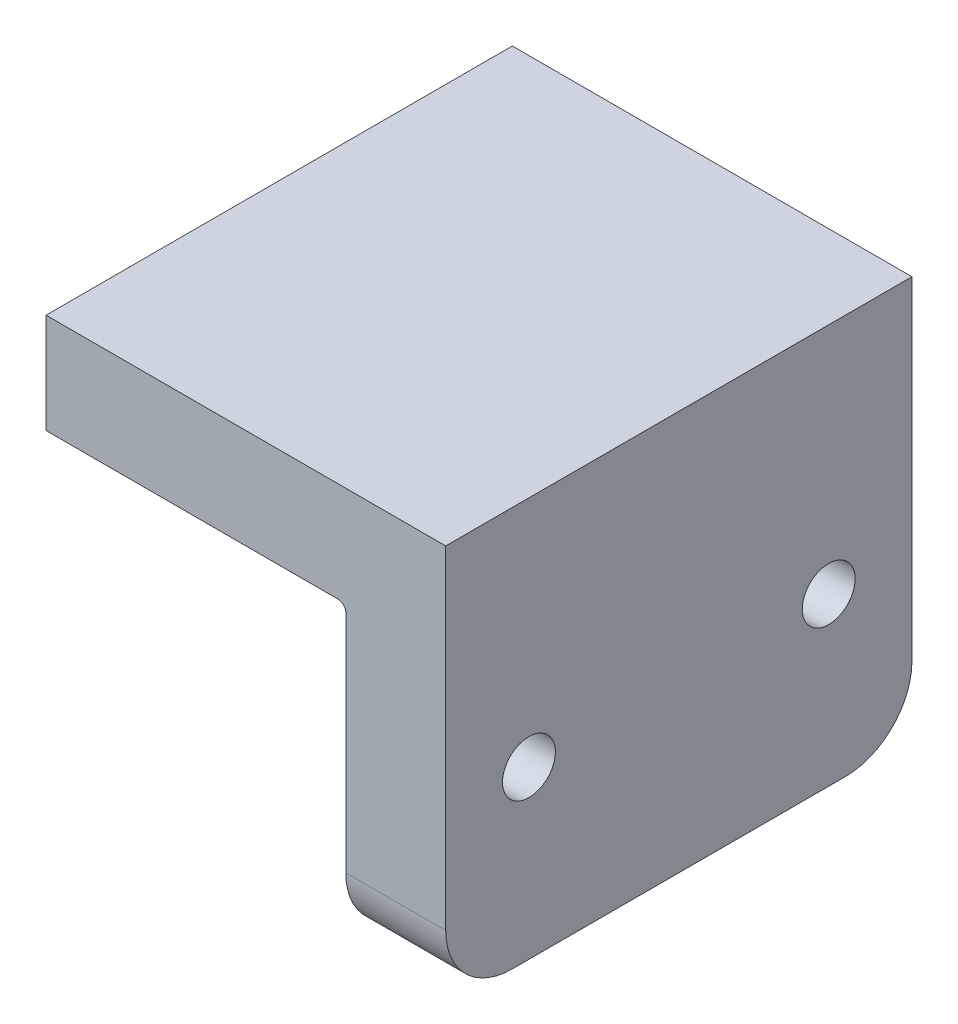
ISO-10303-21;
HEADER;
FILE_DESCRIPTION(('STEP AP214'),'2;1');
FILE_NAME('part.step','',(''),(''),'','','');
FILE_SCHEMA(('AUTOMOTIVE_DESIGN { 1 0 10303 214 1 1 1 1 }'));
ENDSEC;
DATA;
#1=APPLICATION_CONTEXT('core data for automotive mechanical design processes');
#2=APPLICATION_PROTOCOL_DEFINITION('international standard','automotive_design',2000,#1);
#3=PRODUCT_CONTEXT('',#1,'mechanical');
#4=PRODUCT('Part','Part','',(#3));
#5=PRODUCT_RELATED_PRODUCT_CATEGORY('part','',(#4));
#6=PRODUCT_DEFINITION_FORMATION('','',#4);
#7=PRODUCT_DEFINITION_CONTEXT('part definition',#1,'design');
#8=PRODUCT_DEFINITION('design','',#6,#7);
#9=PRODUCT_DEFINITION_SHAPE('','',#8);
#10=(LENGTH_UNIT() NAMED_UNIT(*) SI_UNIT(.MILLI.,.METRE.));
#11=(NAMED_UNIT(*) PLANE_ANGLE_UNIT() SI_UNIT($,.RADIAN.));
#12=(NAMED_UNIT(*) SI_UNIT($,.STERADIAN.) SOLID_ANGLE_UNIT());
#13=UNCERTAINTY_MEASURE_WITH_UNIT(LENGTH_MEASURE(1.E-05),#10,'distance_accuracy_value','');
#14=(GEOMETRIC_REPRESENTATION_CONTEXT(3) GLOBAL_UNCERTAINTY_ASSIGNED_CONTEXT((#13)) GLOBAL_UNIT_ASSIGNED_CONTEXT((#10,
#11,#12)) REPRESENTATION_CONTEXT('',''));
#15=CARTESIAN_POINT('',(0.,0.,0.));
#16=DIRECTION('',(0.,0.,1.));
#17=DIRECTION('',(1.,0.,0.));
#18=AXIS2_PLACEMENT_3D('',#15,#16,#17);
#19=CARTESIAN_POINT('',(0.,0.,44.45));
#20=DIRECTION('',(0.,-1.,0.));
#21=DIRECTION('',(1.,0.,0.));
#22=AXIS2_PLACEMENT_3D('',#19,#20,#21);
#23=PLANE('',#22);
#24=DIRECTION('',(-1.,0.,0.));
#25=VECTOR('',#24,1.);
#26=CARTESIAN_POINT('',(0.,0.,-44.45));
#27=LINE('',#26,#25);
#28=CARTESIAN_POINT('',(0.,0.,-44.45));
#29=VERTEX_POINT('',#28);
#30=CARTESIAN_POINT('',(-76.2,0.,-44.45));
#31=VERTEX_POINT('',#30);
#32=EDGE_CURVE('E135',#29,#31,#27,.T.);
#33=ORIENTED_EDGE('',*,*,#32,.T.);
#34=DIRECTION('',(0.,0.,-1.));
#35=VECTOR('',#34,1.);
#36=CARTESIAN_POINT('',(-76.2,0.,44.45));
#37=LINE('',#36,#35);
#38=CARTESIAN_POINT('',(-76.2,0.,44.45));
#39=VERTEX_POINT('',#38);
#40=EDGE_CURVE('E115',#39,#31,#37,.T.);
#41=ORIENTED_EDGE('',*,*,#40,.F.);
#42=DIRECTION('',(-1.,0.,0.));
#43=VECTOR('',#42,1.);
#44=CARTESIAN_POINT('',(0.,0.,44.45));
#45=LINE('',#44,#43);
#46=CARTESIAN_POINT('',(0.,0.,44.45));
#47=VERTEX_POINT('',#46);
#48=EDGE_CURVE('E123',#47,#39,#45,.T.);
#49=ORIENTED_EDGE('',*,*,#48,.F.);
#50=DIRECTION('',(0.,0.,-1.));
#51=VECTOR('',#50,1.);
#52=CARTESIAN_POINT('',(0.,0.,44.45));
#53=LINE('',#52,#51);
#54=EDGE_CURVE('E181',#47,#29,#53,.T.);
#55=ORIENTED_EDGE('',*,*,#54,.T.);
#56=EDGE_LOOP('',(#33,#41,#49,#55));
#57=FACE_BOUND('',#56,.T.);
#58=ADVANCED_FACE('F36',(#57),#23,.F.);
#59=CARTESIAN_POINT('',(-76.2,0.,44.45));
#60=DIRECTION('',(1.,0.,0.));
#61=DIRECTION('',(0.,1.,0.));
#62=AXIS2_PLACEMENT_3D('',#59,#60,#61);
#63=PLANE('',#62);
#64=DIRECTION('',(0.,-1.,0.));
#65=VECTOR('',#64,1.);
#66=CARTESIAN_POINT('',(-76.2,0.,-44.45));
#67=LINE('',#66,#65);
#68=CARTESIAN_POINT('',(-76.2,-19.05,-44.45));
#69=VERTEX_POINT('',#68);
#70=EDGE_CURVE('E189',#31,#69,#67,.T.);
#71=ORIENTED_EDGE('',*,*,#70,.T.);
#72=DIRECTION('',(0.,0.,-1.));
#73=VECTOR('',#72,1.);
#74=CARTESIAN_POINT('',(-76.2,-19.05,44.45));
#75=LINE('',#74,#73);
#76=CARTESIAN_POINT('',(-76.2,-19.05,44.45));
#77=VERTEX_POINT('',#76);
#78=EDGE_CURVE('E118',#77,#69,#75,.T.);
#79=ORIENTED_EDGE('',*,*,#78,.F.);
#80=DIRECTION('',(0.,-1.,0.));
#81=VECTOR('',#80,1.);
#82=CARTESIAN_POINT('',(-76.2,0.,44.45));
#83=LINE('',#82,#81);
#84=EDGE_CURVE('E111',#39,#77,#83,.T.);
#85=ORIENTED_EDGE('',*,*,#84,.F.);
#86=ORIENTED_EDGE('',*,*,#40,.T.);
#87=EDGE_LOOP('',(#71,#79,#85,#86));
#88=FACE_BOUND('',#87,.T.);
#89=ADVANCED_FACE('F113',(#88),#63,.F.);
#90=CARTESIAN_POINT('',(-76.2,-19.05,44.45));
#91=DIRECTION('',(0.,1.,0.));
#92=DIRECTION('',(0.,0.,1.));
#93=AXIS2_PLACEMENT_3D('',#90,#91,#92);
#94=PLANE('',#93);
#95=DIRECTION('',(1.,0.,0.));
#96=VECTOR('',#95,1.);
#97=CARTESIAN_POINT('',(-76.2,-19.05,-44.45));
#98=LINE('',#97,#96);
#99=CARTESIAN_POINT('',(-20.574,-19.05,-44.45));
#100=VERTEX_POINT('',#99);
#101=EDGE_CURVE('E177',#69,#100,#98,.T.);
#102=ORIENTED_EDGE('',*,*,#101,.T.);
#103=DIRECTION('',(0.,0.,-1.));
#104=VECTOR('',#103,1.);
#105=CARTESIAN_POINT('',(-20.574,-19.05,44.45));
#106=LINE('',#105,#104);
#107=CARTESIAN_POINT('',(-20.574,-19.05,44.45));
#108=VERTEX_POINT('',#107);
#109=EDGE_CURVE('E139',#100,#108,#106,.F.);
#110=ORIENTED_EDGE('',*,*,#109,.T.);
#111=DIRECTION('',(1.,0.,0.));
#112=VECTOR('',#111,1.);
#113=CARTESIAN_POINT('',(-76.2,-19.05,44.45));
#114=LINE('',#113,#112);
#115=EDGE_CURVE('E122',#77,#108,#114,.T.);
#116=ORIENTED_EDGE('',*,*,#115,.F.);
#117=ORIENTED_EDGE('',*,*,#78,.T.);
#118=EDGE_LOOP('',(#102,#110,#116,#117));
#119=FACE_BOUND('',#118,.T.);
#120=ADVANCED_FACE('F195',(#119),#94,.F.);
#121=CARTESIAN_POINT('',(-19.05,-19.05,44.45));
#122=DIRECTION('',(1.,0.,0.));
#123=DIRECTION('',(0.,1.,0.));
#124=AXIS2_PLACEMENT_3D('',#121,#122,#123);
#125=PLANE('',#124);
#126=CARTESIAN_POINT('',(-19.05,-44.45,-28.575));
#127=DIRECTION('',(-1.,0.,0.));
#128=DIRECTION('',(0.,0.,1.));
#129=AXIS2_PLACEMENT_3D('',#126,#127,#128);
#130=CIRCLE('',#129,7.9375);
#131=CARTESIAN_POINT('',(-19.05,-44.45,-20.6375));
#132=VERTEX_POINT('',#131);
#133=EDGE_CURVE('E213',#132,#132,#130,.T.);
#134=ORIENTED_EDGE('',*,*,#133,.F.);
#135=EDGE_LOOP('',(#134));
#136=FACE_BOUND('',#135,.T.);
#137=CARTESIAN_POINT('',(-19.05,-44.45,28.575));
#138=DIRECTION('',(-1.,0.,0.));
#139=DIRECTION('',(0.,0.,1.));
#140=AXIS2_PLACEMENT_3D('',#137,#138,#139);
#141=CIRCLE('',#140,7.9375);
#142=CARTESIAN_POINT('',(-19.05,-44.45,36.5125));
#143=VERTEX_POINT('',#142);
#144=EDGE_CURVE('E190',#143,#143,#141,.T.);
#145=ORIENTED_EDGE('',*,*,#144,.F.);
#146=EDGE_LOOP('',(#145));
#147=FACE_BOUND('',#146,.T.);
#148=DIRECTION('',(0.,-1.,0.));
#149=VECTOR('',#148,1.);
#150=CARTESIAN_POINT('',(-19.05,-19.05,-44.45));
#151=LINE('',#150,#149);
#152=CARTESIAN_POINT('',(-19.05,-20.574,-44.45));
#153=VERTEX_POINT('',#152);
#154=CARTESIAN_POINT('',(-19.05,-63.5,-44.45));
#155=VERTEX_POINT('',#154);
#156=EDGE_CURVE('E163',#153,#155,#151,.T.);
#157=ORIENTED_EDGE('',*,*,#156,.T.);
#158=CARTESIAN_POINT('',(-19.05,-63.5,-31.75));
#159=DIRECTION('',(1.,0.,0.));
#160=DIRECTION('',(0.,1.,0.));
#161=AXIS2_PLACEMENT_3D('',#158,#159,#160);
#162=CIRCLE('',#161,12.7);
#163=CARTESIAN_POINT('',(-19.05,-76.2,-31.75));
#164=VERTEX_POINT('',#163);
#165=EDGE_CURVE('E44',#155,#164,#162,.F.);
#166=ORIENTED_EDGE('',*,*,#165,.T.);
#167=DIRECTION('',(0.,0.,-1.));
#168=VECTOR('',#167,1.);
#169=CARTESIAN_POINT('',(-19.05,-76.2,44.45));
#170=LINE('',#169,#168);
#171=CARTESIAN_POINT('',(-19.05,-76.2,31.75));
#172=VERTEX_POINT('',#171);
#173=EDGE_CURVE('E141',#172,#164,#170,.T.);
#174=ORIENTED_EDGE('',*,*,#173,.F.);
#175=CARTESIAN_POINT('',(-19.05,-63.5,31.75));
#176=DIRECTION('',(1.,0.,0.));
#177=DIRECTION('',(0.,1.,0.));
#178=AXIS2_PLACEMENT_3D('',#175,#176,#177);
#179=CIRCLE('',#178,12.7);
#180=CARTESIAN_POINT('',(-19.05,-63.5,44.45));
#181=VERTEX_POINT('',#180);
#182=EDGE_CURVE('E51',#172,#181,#179,.F.);
#183=ORIENTED_EDGE('',*,*,#182,.T.);
#184=DIRECTION('',(0.,-1.,0.));
#185=VECTOR('',#184,1.);
#186=CARTESIAN_POINT('',(-19.05,-19.05,44.45));
#187=LINE('',#186,#185);
#188=CARTESIAN_POINT('',(-19.05,-20.574,44.45));
#189=VERTEX_POINT('',#188);
#190=EDGE_CURVE('E183',#189,#181,#187,.T.);
#191=ORIENTED_EDGE('',*,*,#190,.F.);
#192=DIRECTION('',(0.,0.,-1.));
#193=VECTOR('',#192,1.);
#194=CARTESIAN_POINT('',(-19.05,-20.574,-44.45));
#195=LINE('',#194,#193);
#196=EDGE_CURVE('E136',#189,#153,#195,.T.);
#197=ORIENTED_EDGE('',*,*,#196,.T.);
#198=EDGE_LOOP('',(#157,#166,#174,#183,#191,#197));
#199=FACE_BOUND('',#198,.T.);
#200=ADVANCED_FACE('F162',(#136,#147,#199),#125,.F.);
#201=CARTESIAN_POINT('',(0.,0.,44.45));
#202=DIRECTION('',(-1.,0.,0.));
#203=DIRECTION('',(0.,-1.,0.));
#204=AXIS2_PLACEMENT_3D('',#201,#202,#203);
#205=PLANE('',#204);
#206=CARTESIAN_POINT('',(0.,-44.45,-28.575));
#207=DIRECTION('',(-1.,0.,0.));
#208=DIRECTION('',(0.,0.,1.));
#209=AXIS2_PLACEMENT_3D('',#206,#207,#208);
#210=CIRCLE('',#209,5.04189999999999);
#211=CARTESIAN_POINT('',(0.,-44.45,-23.5331));
#212=VERTEX_POINT('',#211);
#213=EDGE_CURVE('E222',#212,#212,#210,.T.);
#214=ORIENTED_EDGE('',*,*,#213,.T.);
#215=EDGE_LOOP('',(#214));
#216=FACE_BOUND('',#215,.T.);
#217=CARTESIAN_POINT('',(0.,-44.45,28.575));
#218=DIRECTION('',(-1.,0.,0.));
#219=DIRECTION('',(0.,0.,1.));
#220=AXIS2_PLACEMENT_3D('',#217,#218,#219);
#221=CIRCLE('',#220,5.04189999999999);
#222=CARTESIAN_POINT('',(0.,-44.45,33.6169));
#223=VERTEX_POINT('',#222);
#224=EDGE_CURVE('E210',#223,#223,#221,.T.);
#225=ORIENTED_EDGE('',*,*,#224,.T.);
#226=EDGE_LOOP('',(#225));
#227=FACE_BOUND('',#226,.T.);
#228=DIRECTION('',(0.,0.,-1.));
#229=VECTOR('',#228,1.);
#230=CARTESIAN_POINT('',(0.,-76.2,44.45));
#231=LINE('',#230,#229);
#232=CARTESIAN_POINT('',(0.,-76.2,31.75));
#233=VERTEX_POINT('',#232);
#234=CARTESIAN_POINT('',(0.,-76.2,-31.75));
#235=VERTEX_POINT('',#234);
#236=EDGE_CURVE('E171',#233,#235,#231,.T.);
#237=ORIENTED_EDGE('',*,*,#236,.T.);
#238=CARTESIAN_POINT('',(0.,-63.5,-31.75));
#239=DIRECTION('',(-1.,0.,0.));
#240=DIRECTION('',(0.,-1.,0.));
#241=AXIS2_PLACEMENT_3D('',#238,#239,#240);
#242=CIRCLE('',#241,12.7);
#243=CARTESIAN_POINT('',(0.,-63.5,-44.45));
#244=VERTEX_POINT('',#243);
#245=EDGE_CURVE('E157',#235,#244,#242,.F.);
#246=ORIENTED_EDGE('',*,*,#245,.T.);
#247=DIRECTION('',(0.,1.,0.));
#248=VECTOR('',#247,1.);
#249=CARTESIAN_POINT('',(0.,0.,-44.45));
#250=LINE('',#249,#248);
#251=EDGE_CURVE('E132',#244,#29,#250,.T.);
#252=ORIENTED_EDGE('',*,*,#251,.T.);
#253=ORIENTED_EDGE('',*,*,#54,.F.);
#254=DIRECTION('',(0.,1.,0.));
#255=VECTOR('',#254,1.);
#256=CARTESIAN_POINT('',(0.,0.,44.45));
#257=LINE('',#256,#255);
#258=CARTESIAN_POINT('',(0.,-63.5,44.45));
#259=VERTEX_POINT('',#258);
#260=EDGE_CURVE('E128',#259,#47,#257,.T.);
#261=ORIENTED_EDGE('',*,*,#260,.F.);
#262=CARTESIAN_POINT('',(0.,-63.5,31.75));
#263=DIRECTION('',(-1.,0.,0.));
#264=DIRECTION('',(0.,-1.,0.));
#265=AXIS2_PLACEMENT_3D('',#262,#263,#264);
#266=CIRCLE('',#265,12.7);
#267=EDGE_CURVE('E155',#259,#233,#266,.F.);
#268=ORIENTED_EDGE('',*,*,#267,.T.);
#269=EDGE_LOOP('',(#237,#246,#252,#253,#261,#268));
#270=FACE_BOUND('',#269,.T.);
#271=ADVANCED_FACE('F174',(#216,#227,#270),#205,.F.);
#272=CARTESIAN_POINT('',(0.,0.,44.45));
#273=DIRECTION('',(0.,0.,1.));
#274=DIRECTION('',(1.,0.,0.));
#275=AXIS2_PLACEMENT_3D('',#272,#273,#274);
#276=PLANE('',#275);
#277=ORIENTED_EDGE('',*,*,#190,.T.);
#278=DIRECTION('',(1.,0.,0.));
#279=VECTOR('',#278,1.);
#280=CARTESIAN_POINT('',(0.,-63.5,44.45));
#281=LINE('',#280,#279);
#282=EDGE_CURVE('E11',#181,#259,#281,.T.);
#283=ORIENTED_EDGE('',*,*,#282,.T.);
#284=ORIENTED_EDGE('',*,*,#260,.T.);
#285=ORIENTED_EDGE('',*,*,#48,.T.);
#286=ORIENTED_EDGE('',*,*,#84,.T.);
#287=ORIENTED_EDGE('',*,*,#115,.T.);
#288=CARTESIAN_POINT('',(-20.574,-20.574,44.45));
#289=DIRECTION('',(0.,0.,1.));
#290=DIRECTION('',(1.,0.,0.));
#291=AXIS2_PLACEMENT_3D('',#288,#289,#290);
#292=CIRCLE('',#291,1.524);
#293=EDGE_CURVE('E148',#108,#189,#292,.F.);
#294=ORIENTED_EDGE('',*,*,#293,.T.);
#295=EDGE_LOOP('',(#277,#283,#284,#285,#286,#287,#294));
#296=FACE_BOUND('',#295,.T.);
#297=ADVANCED_FACE('F126',(#296),#276,.T.);
#298=CARTESIAN_POINT('',(0.,0.,-44.45));
#299=DIRECTION('',(0.,0.,1.));
#300=DIRECTION('',(1.,0.,0.));
#301=AXIS2_PLACEMENT_3D('',#298,#299,#300);
#302=PLANE('',#301);
#303=ORIENTED_EDGE('',*,*,#251,.F.);
#304=DIRECTION('',(1.,0.,0.));
#305=VECTOR('',#304,1.);
#306=CARTESIAN_POINT('',(0.,-63.5,-44.45));
#307=LINE('',#306,#305);
#308=EDGE_CURVE('E59',#244,#155,#307,.F.);
#309=ORIENTED_EDGE('',*,*,#308,.T.);
#310=ORIENTED_EDGE('',*,*,#156,.F.);
#311=CARTESIAN_POINT('',(-20.574,-20.574,-44.45));
#312=DIRECTION('',(0.,0.,1.));
#313=DIRECTION('',(1.,0.,0.));
#314=AXIS2_PLACEMENT_3D('',#311,#312,#313);
#315=CIRCLE('',#314,1.524);
#316=EDGE_CURVE('E146',#153,#100,#315,.T.);
#317=ORIENTED_EDGE('',*,*,#316,.T.);
#318=ORIENTED_EDGE('',*,*,#101,.F.);
#319=ORIENTED_EDGE('',*,*,#70,.F.);
#320=ORIENTED_EDGE('',*,*,#32,.F.);
#321=EDGE_LOOP('',(#303,#309,#310,#317,#318,#319,#320));
#322=FACE_BOUND('',#321,.T.);
#323=ADVANCED_FACE('F175',(#322),#302,.F.);
#324=CARTESIAN_POINT('',(-20.574,-20.574,44.45));
#325=DIRECTION('',(0.,0.,1.));
#326=DIRECTION('',(1.,0.,0.));
#327=AXIS2_PLACEMENT_3D('',#324,#325,#326);
#328=CYLINDRICAL_SURFACE('',#327,1.524);
#329=ORIENTED_EDGE('',*,*,#293,.F.);
#330=ORIENTED_EDGE('',*,*,#109,.F.);
#331=ORIENTED_EDGE('',*,*,#316,.F.);
#332=ORIENTED_EDGE('',*,*,#196,.F.);
#333=EDGE_LOOP('',(#329,#330,#331,#332));
#334=FACE_BOUND('',#333,.T.);
#335=ADVANCED_FACE('F198',(#334),#328,.F.);
#336=CARTESIAN_POINT('',(-19.05,-44.45,28.575));
#337=DIRECTION('',(-1.,0.,0.));
#338=DIRECTION('',(0.,0.,1.));
#339=AXIS2_PLACEMENT_3D('',#336,#337,#338);
#340=CYLINDRICAL_SURFACE('',#339,7.9375);
#341=CARTESIAN_POINT('',(-9.525,-44.45,28.575));
#342=DIRECTION('',(-1.,0.,0.));
#343=DIRECTION('',(0.,0.,1.));
#344=AXIS2_PLACEMENT_3D('',#341,#342,#343);
#345=CIRCLE('',#344,7.9375);
#346=CARTESIAN_POINT('',(-9.525,-44.45,36.5125));
#347=VERTEX_POINT('',#346);
#348=EDGE_CURVE('E204',#347,#347,#345,.T.);
#349=ORIENTED_EDGE('',*,*,#348,.F.);
#350=EDGE_LOOP('',(#349));
#351=FACE_BOUND('',#350,.T.);
#352=ORIENTED_EDGE('',*,*,#144,.T.);
#353=EDGE_LOOP('',(#352));
#354=FACE_BOUND('',#353,.T.);
#355=ADVANCED_FACE('F252',(#351,#354),#340,.F.);
#356=CARTESIAN_POINT('',(-9.525,-39.4081,28.575));
#357=DIRECTION('',(1.,0.,0.));
#358=DIRECTION('',(0.,0.,-1.));
#359=AXIS2_PLACEMENT_3D('',#356,#357,#358);
#360=PLANE('',#359);
#361=CARTESIAN_POINT('',(-9.525,-44.45,28.575));
#362=DIRECTION('',(-1.,0.,0.));
#363=DIRECTION('',(0.,0.,1.));
#364=AXIS2_PLACEMENT_3D('',#361,#362,#363);
#365=CIRCLE('',#364,5.0419);
#366=CARTESIAN_POINT('',(-9.525,-44.45,33.6169));
#367=VERTEX_POINT('',#366);
#368=EDGE_CURVE('E207',#367,#367,#365,.T.);
#369=ORIENTED_EDGE('',*,*,#368,.F.);
#370=EDGE_LOOP('',(#369));
#371=FACE_BOUND('',#370,.T.);
#372=ORIENTED_EDGE('',*,*,#348,.T.);
#373=EDGE_LOOP('',(#372));
#374=FACE_BOUND('',#373,.T.);
#375=ADVANCED_FACE('F254',(#371,#374),#360,.F.);
#376=CARTESIAN_POINT('',(-19.05,-44.45,28.575));
#377=DIRECTION('',(-1.,0.,0.));
#378=DIRECTION('',(0.,0.,1.));
#379=AXIS2_PLACEMENT_3D('',#376,#377,#378);
#380=CYLINDRICAL_SURFACE('',#379,5.0419);
#381=ORIENTED_EDGE('',*,*,#224,.F.);
#382=EDGE_LOOP('',(#381));
#383=FACE_BOUND('',#382,.T.);
#384=ORIENTED_EDGE('',*,*,#368,.T.);
#385=EDGE_LOOP('',(#384));
#386=FACE_BOUND('',#385,.T.);
#387=ADVANCED_FACE('F243',(#383,#386),#380,.F.);
#388=CARTESIAN_POINT('',(-19.05,-44.45,-28.575));
#389=DIRECTION('',(-1.,0.,0.));
#390=DIRECTION('',(0.,0.,1.));
#391=AXIS2_PLACEMENT_3D('',#388,#389,#390);
#392=CYLINDRICAL_SURFACE('',#391,7.9375);
#393=CARTESIAN_POINT('',(-9.525,-44.45,-28.575));
#394=DIRECTION('',(-1.,0.,0.));
#395=DIRECTION('',(0.,0.,1.));
#396=AXIS2_PLACEMENT_3D('',#393,#394,#395);
#397=CIRCLE('',#396,7.9375);
#398=CARTESIAN_POINT('',(-9.525,-44.45,-20.6375));
#399=VERTEX_POINT('',#398);
#400=EDGE_CURVE('E216',#399,#399,#397,.T.);
#401=ORIENTED_EDGE('',*,*,#400,.F.);
#402=EDGE_LOOP('',(#401));
#403=FACE_BOUND('',#402,.T.);
#404=ORIENTED_EDGE('',*,*,#133,.T.);
#405=EDGE_LOOP('',(#404));
#406=FACE_BOUND('',#405,.T.);
#407=ADVANCED_FACE('F237',(#403,#406),#392,.F.);
#408=CARTESIAN_POINT('',(-9.525,-39.4081,-28.575));
#409=DIRECTION('',(1.,0.,0.));
#410=DIRECTION('',(0.,0.,-1.));
#411=AXIS2_PLACEMENT_3D('',#408,#409,#410);
#412=PLANE('',#411);
#413=CARTESIAN_POINT('',(-9.525,-44.45,-28.575));
#414=DIRECTION('',(-1.,0.,0.));
#415=DIRECTION('',(0.,0.,1.));
#416=AXIS2_PLACEMENT_3D('',#413,#414,#415);
#417=CIRCLE('',#416,5.0419);
#418=CARTESIAN_POINT('',(-9.525,-44.45,-23.5331));
#419=VERTEX_POINT('',#418);
#420=EDGE_CURVE('E219',#419,#419,#417,.T.);
#421=ORIENTED_EDGE('',*,*,#420,.F.);
#422=EDGE_LOOP('',(#421));
#423=FACE_BOUND('',#422,.T.);
#424=ORIENTED_EDGE('',*,*,#400,.T.);
#425=EDGE_LOOP('',(#424));
#426=FACE_BOUND('',#425,.T.);
#427=ADVANCED_FACE('F231',(#423,#426),#412,.F.);
#428=CARTESIAN_POINT('',(-19.05,-44.45,-28.575));
#429=DIRECTION('',(-1.,0.,0.));
#430=DIRECTION('',(0.,0.,1.));
#431=AXIS2_PLACEMENT_3D('',#428,#429,#430);
#432=CYLINDRICAL_SURFACE('',#431,5.0419);
#433=ORIENTED_EDGE('',*,*,#213,.F.);
#434=EDGE_LOOP('',(#433));
#435=FACE_BOUND('',#434,.T.);
#436=ORIENTED_EDGE('',*,*,#420,.T.);
#437=EDGE_LOOP('',(#436));
#438=FACE_BOUND('',#437,.T.);
#439=ADVANCED_FACE('F228',(#435,#438),#432,.F.);
#440=CARTESIAN_POINT('',(0.,-63.5,-31.75));
#441=DIRECTION('',(1.,0.,0.));
#442=DIRECTION('',(0.,0.,-1.));
#443=AXIS2_PLACEMENT_3D('',#440,#441,#442);
#444=CYLINDRICAL_SURFACE('',#443,12.7);
#445=ORIENTED_EDGE('',*,*,#165,.F.);
#446=ORIENTED_EDGE('',*,*,#308,.F.);
#447=ORIENTED_EDGE('',*,*,#245,.F.);
#448=DIRECTION('',(1.,0.,0.));
#449=VECTOR('',#448,1.);
#450=CARTESIAN_POINT('',(0.,-76.2,-31.75));
#451=LINE('',#450,#449);
#452=EDGE_CURVE('E152',#164,#235,#451,.T.);
#453=ORIENTED_EDGE('',*,*,#452,.F.);
#454=EDGE_LOOP('',(#445,#446,#447,#453));
#455=FACE_BOUND('',#454,.T.);
#456=ADVANCED_FACE('F172',(#455),#444,.T.);
#457=CARTESIAN_POINT('',(0.,-63.5,31.75));
#458=DIRECTION('',(-1.,0.,0.));
#459=DIRECTION('',(0.,0.,1.));
#460=AXIS2_PLACEMENT_3D('',#457,#458,#459);
#461=CYLINDRICAL_SURFACE('',#460,12.7);
#462=ORIENTED_EDGE('',*,*,#182,.F.);
#463=DIRECTION('',(1.,0.,0.));
#464=VECTOR('',#463,1.);
#465=CARTESIAN_POINT('',(-19.05,-76.2,31.75));
#466=LINE('',#465,#464);
#467=EDGE_CURVE('E150',#233,#172,#466,.F.);
#468=ORIENTED_EDGE('',*,*,#467,.F.);
#469=ORIENTED_EDGE('',*,*,#267,.F.);
#470=ORIENTED_EDGE('',*,*,#282,.F.);
#471=EDGE_LOOP('',(#462,#468,#469,#470));
#472=FACE_BOUND('',#471,.T.);
#473=ADVANCED_FACE('F38',(#472),#461,.T.);
#474=CARTESIAN_POINT('',(0.,-76.2,44.45));
#475=DIRECTION('',(0.,1.,0.));
#476=DIRECTION('',(0.,0.,1.));
#477=AXIS2_PLACEMENT_3D('',#474,#475,#476);
#478=PLANE('',#477);
#479=ORIENTED_EDGE('',*,*,#173,.T.);
#480=ORIENTED_EDGE('',*,*,#452,.T.);
#481=ORIENTED_EDGE('',*,*,#236,.F.);
#482=ORIENTED_EDGE('',*,*,#467,.T.);
#483=EDGE_LOOP('',(#479,#480,#481,#482));
#484=FACE_BOUND('',#483,.T.);
#485=ADVANCED_FACE('F167',(#484),#478,.F.);
#486=CLOSED_SHELL('',(#58,#89,#120,#200,#271,#297,#323,#335,#355,#375,#387,#407,#427,#439,#456,
#473,#485));
#487=MANIFOLD_SOLID_BREP('B2',#486);
#488=ADVANCED_BREP_SHAPE_REPRESENTATION('',(#18,#487),#14);
#489=SHAPE_DEFINITION_REPRESENTATION(#9,#488);
ENDSEC;
END-ISO-10303-21;
